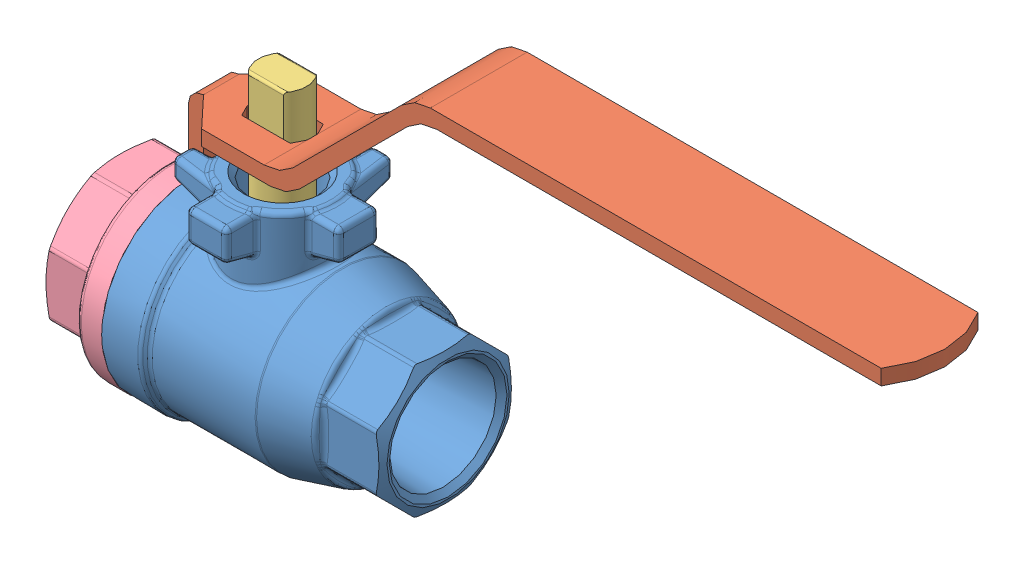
SolidWorks assembly J.S.COCK-MAR00003.SLDASM, configuration Default (file format 7000). Lengths in mm.
Overall size (162.5 80.65 36.69).
4 component instances, 4 part files, 0 mates.
Components (placement in the parent):
- J.S.COCK-MAR00003_2_1-1: J.S.COCK-MAR00003_2_1.sldprt [Default] at (-2.3163 -4.301 0) size (50.35 45.92 36.69)
- J.S.COCK-MAR00003_1_1-1: J.S.COCK-MAR00003_1_1.sldprt [Default] at (-2.3163 31.999 0) size (145 39.5 19)
- J.S.COCK-MAR00003_3_1-1: J.S.COCK-MAR00003_3_1.sldprt [Default] at (-2.3163 5.499 0) x (0 1 0) z (0 0 -1) size (34.5 12.2 12.2)
- J.S.COCK-MAR00003_4_1-1: J.S.COCK-MAR00003_4_1.sldprt [Default] at (-9.8163 -4.301 0) size (25 36 36)
